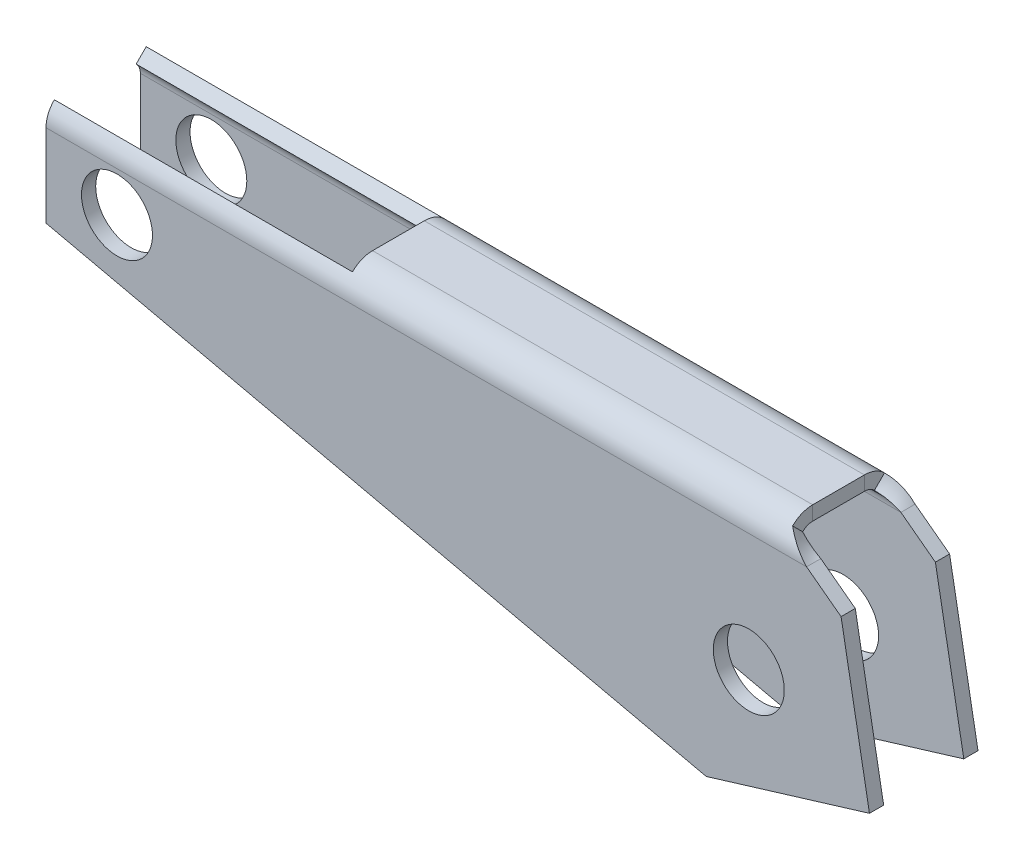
ISO-10303-21;
HEADER;
FILE_DESCRIPTION(('STEP AP214'),'2;1');
FILE_NAME('part.step','',(''),(''),'','','');
FILE_SCHEMA(('AUTOMOTIVE_DESIGN { 1 0 10303 214 1 1 1 1 }'));
ENDSEC;
DATA;
#1=APPLICATION_CONTEXT('core data for automotive mechanical design processes');
#2=APPLICATION_PROTOCOL_DEFINITION('international standard','automotive_design',2000,#1);
#3=PRODUCT_CONTEXT('',#1,'mechanical');
#4=PRODUCT('Part','Part','',(#3));
#5=PRODUCT_RELATED_PRODUCT_CATEGORY('part','',(#4));
#6=PRODUCT_DEFINITION_FORMATION('','',#4);
#7=PRODUCT_DEFINITION_CONTEXT('part definition',#1,'design');
#8=PRODUCT_DEFINITION('design','',#6,#7);
#9=PRODUCT_DEFINITION_SHAPE('','',#8);
#10=(LENGTH_UNIT() NAMED_UNIT(*) SI_UNIT(.MILLI.,.METRE.));
#11=(NAMED_UNIT(*) PLANE_ANGLE_UNIT() SI_UNIT($,.RADIAN.));
#12=(NAMED_UNIT(*) SI_UNIT($,.STERADIAN.) SOLID_ANGLE_UNIT());
#13=UNCERTAINTY_MEASURE_WITH_UNIT(LENGTH_MEASURE(1.E-05),#10,'distance_accuracy_value','');
#14=(GEOMETRIC_REPRESENTATION_CONTEXT(3) GLOBAL_UNCERTAINTY_ASSIGNED_CONTEXT((#13)) GLOBAL_UNIT_ASSIGNED_CONTEXT((#10,
#11,#12)) REPRESENTATION_CONTEXT('',''));
#15=CARTESIAN_POINT('',(0.,0.,0.));
#16=DIRECTION('',(0.,0.,1.));
#17=DIRECTION('',(1.,0.,0.));
#18=AXIS2_PLACEMENT_3D('',#15,#16,#17);
#19=CARTESIAN_POINT('',(-18.,10.9999999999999,13.2876110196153));
#20=DIRECTION('',(0.599999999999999,0.800000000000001,0.));
#21=DIRECTION('',(0.800000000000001,-0.599999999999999,0.));
#22=AXIS2_PLACEMENT_3D('',#19,#20,#21);
#23=PLANE('',#22);
#24=DIRECTION('',(0.800000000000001,-0.599999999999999,0.));
#25=VECTOR('',#24,1.);
#26=CARTESIAN_POINT('',(-18.,11.,11.2876110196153));
#27=LINE('',#26,#25);
#28=CARTESIAN_POINT('',(-14.8584073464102,8.64380550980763,11.2876110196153));
#29=VERTEX_POINT('',#28);
#30=CARTESIAN_POINT('',(-9.99999999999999,4.99999999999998,11.2876110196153));
#31=VERTEX_POINT('',#30);
#32=EDGE_CURVE('E544',#29,#31,#27,.T.);
#33=ORIENTED_EDGE('',*,*,#32,.F.);
#34=CARTESIAN_POINT('',(-14.8584073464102,8.64380550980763,13.2876110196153));
#35=CARTESIAN_POINT('',(-14.8584073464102,8.64380550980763,11.2876110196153));
#36=B_SPLINE_CURVE_WITH_KNOTS('',1,(#34,#35),.UNSPECIFIED.,.F.,.F.,(2,2),(0.,1.),.UNSPECIFIED.);
#37=CARTESIAN_POINT('',(-14.8584073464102,8.6438055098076,13.2876110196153));
#38=VERTEX_POINT('',#37);
#39=EDGE_CURVE('E40',#29,#38,#36,.F.);
#40=ORIENTED_EDGE('',*,*,#39,.T.);
#41=DIRECTION('',(0.800000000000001,-0.599999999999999,0.));
#42=VECTOR('',#41,1.);
#43=CARTESIAN_POINT('',(-18.,10.9999999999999,13.2876110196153));
#44=LINE('',#43,#42);
#45=CARTESIAN_POINT('',(-9.99999999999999,4.99999999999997,13.2876110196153));
#46=VERTEX_POINT('',#45);
#47=EDGE_CURVE('E85',#38,#46,#44,.T.);
#48=ORIENTED_EDGE('',*,*,#47,.T.);
#49=DIRECTION('',(0.,0.,-1.));
#50=VECTOR('',#49,1.);
#51=CARTESIAN_POINT('',(-9.99999999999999,4.99999999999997,13.2876110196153));
#52=LINE('',#51,#50);
#53=EDGE_CURVE('E546',#46,#31,#52,.T.);
#54=ORIENTED_EDGE('',*,*,#53,.T.);
#55=EDGE_LOOP('',(#33,#40,#48,#54));
#56=FACE_BOUND('',#55,.T.);
#57=ADVANCED_FACE('F31',(#56),#23,.T.);
#58=CARTESIAN_POINT('',(-122.,11.,13.2876110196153));
#59=DIRECTION('',(-1.,0.,0.));
#60=DIRECTION('',(0.,0.,-1.));
#61=AXIS2_PLACEMENT_3D('',#58,#59,#60);
#62=PLANE('',#61);
#63=DIRECTION('',(0.,1.,0.));
#64=VECTOR('',#63,1.);
#65=CARTESIAN_POINT('',(-122.,11.,13.2876110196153));
#66=LINE('',#65,#64);
#67=CARTESIAN_POINT('',(-122.,-3.00000000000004,13.2876110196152));
#68=VERTEX_POINT('',#67);
#69=CARTESIAN_POINT('',(-122.,8.6438055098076,13.2876110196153));
#70=VERTEX_POINT('',#69);
#71=EDGE_CURVE('E580',#68,#70,#66,.T.);
#72=ORIENTED_EDGE('',*,*,#71,.T.);
#73=DIRECTION('',(0.,0.,-1.));
#74=VECTOR('',#73,1.);
#75=CARTESIAN_POINT('',(-122.,8.64380550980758,13.2876110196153));
#76=LINE('',#75,#74);
#77=CARTESIAN_POINT('',(-122.,8.64380550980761,11.2876110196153));
#78=VERTEX_POINT('',#77);
#79=EDGE_CURVE('E575',#70,#78,#76,.T.);
#80=ORIENTED_EDGE('',*,*,#79,.T.);
#81=DIRECTION('',(0.,1.,0.));
#82=VECTOR('',#81,1.);
#83=CARTESIAN_POINT('',(-122.,11.,11.2876110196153));
#84=LINE('',#83,#82);
#85=CARTESIAN_POINT('',(-122.,-3.00000000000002,11.2876110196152));
#86=VERTEX_POINT('',#85);
#87=EDGE_CURVE('E571',#86,#78,#84,.T.);
#88=ORIENTED_EDGE('',*,*,#87,.F.);
#89=DIRECTION('',(0.,0.,-1.));
#90=VECTOR('',#89,1.);
#91=CARTESIAN_POINT('',(-122.,-3.00000000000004,13.2876110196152));
#92=LINE('',#91,#90);
#93=EDGE_CURVE('E58',#68,#86,#92,.T.);
#94=ORIENTED_EDGE('',*,*,#93,.F.);
#95=EDGE_LOOP('',(#72,#80,#88,#94));
#96=FACE_BOUND('',#95,.T.);
#97=ADVANCED_FACE('F522',(#96),#62,.T.);
#98=CARTESIAN_POINT('',(-122.,11.,13.2876110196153));
#99=DIRECTION('',(0.,0.,1.));
#100=DIRECTION('',(-1.,0.,0.));
#101=AXIS2_PLACEMENT_3D('',#98,#99,#100);
#102=PLANE('',#101);
#103=CARTESIAN_POINT('',(-23.,-8.00000000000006,13.2876110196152));
#104=DIRECTION('',(0.,0.,-1.));
#105=DIRECTION('',(-1.,0.,0.));
#106=AXIS2_PLACEMENT_3D('',#103,#104,#105);
#107=CIRCLE('',#106,5.);
#108=CARTESIAN_POINT('',(-28.,-8.00000000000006,13.2876110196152));
#109=VERTEX_POINT('',#108);
#110=EDGE_CURVE('E600',#109,#109,#107,.T.);
#111=ORIENTED_EDGE('',*,*,#110,.T.);
#112=EDGE_LOOP('',(#111));
#113=FACE_BOUND('',#112,.T.);
#114=CARTESIAN_POINT('',(-112.,2.99999999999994,13.2876110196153));
#115=DIRECTION('',(0.,0.,-1.));
#116=DIRECTION('',(-1.,0.,0.));
#117=AXIS2_PLACEMENT_3D('',#114,#115,#116);
#118=CIRCLE('',#117,5.);
#119=CARTESIAN_POINT('',(-117.,2.99999999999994,13.2876110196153));
#120=VERTEX_POINT('',#119);
#121=EDGE_CURVE('E550',#120,#120,#118,.T.);
#122=ORIENTED_EDGE('',*,*,#121,.T.);
#123=EDGE_LOOP('',(#122));
#124=FACE_BOUND('',#123,.T.);
#125=ORIENTED_EDGE('',*,*,#47,.F.);
#126=DIRECTION('',(-1.,0.,0.));
#127=VECTOR('',#126,1.);
#128=CARTESIAN_POINT('',(-122.,8.64380550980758,13.2876110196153));
#129=LINE('',#128,#127);
#130=EDGE_CURVE('E214',#38,#70,#129,.T.);
#131=ORIENTED_EDGE('',*,*,#130,.T.);
#132=ORIENTED_EDGE('',*,*,#71,.F.);
#133=DIRECTION('',(-0.975441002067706,0.220260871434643,0.));
#134=VECTOR('',#133,1.);
#135=CARTESIAN_POINT('',(-29.,-24.,13.2876110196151));
#136=LINE('',#135,#134);
#137=CARTESIAN_POINT('',(-29.,-24.,13.2876110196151));
#138=VERTEX_POINT('',#137);
#139=EDGE_CURVE('E592',#138,#68,#136,.T.);
#140=ORIENTED_EDGE('',*,*,#139,.F.);
#141=DIRECTION('',(-0.956673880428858,-0.291161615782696,0.));
#142=VECTOR('',#141,1.);
#143=CARTESIAN_POINT('',(-5.99999999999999,-17.,13.2876110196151));
#144=LINE('',#143,#142);
#145=CARTESIAN_POINT('',(-5.99999999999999,-17.,13.2876110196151));
#146=VERTEX_POINT('',#145);
#147=EDGE_CURVE('E594',#146,#138,#144,.T.);
#148=ORIENTED_EDGE('',*,*,#147,.F.);
#149=DIRECTION('',(0.178885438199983,-0.983869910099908,0.));
#150=VECTOR('',#149,1.);
#151=CARTESIAN_POINT('',(-9.99999999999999,4.99999999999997,13.2876110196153));
#152=LINE('',#151,#150);
#153=EDGE_CURVE('E570',#46,#146,#152,.T.);
#154=ORIENTED_EDGE('',*,*,#153,.F.);
#155=EDGE_LOOP('',(#125,#131,#132,#140,#148,#154));
#156=FACE_BOUND('',#155,.T.);
#157=ADVANCED_FACE('F518',(#113,#124,#156),#102,.T.);
#158=CARTESIAN_POINT('',(-29.,-24.,13.2876110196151));
#159=DIRECTION('',(-0.220260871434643,-0.975441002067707,0.));
#160=DIRECTION('',(-0.975441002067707,0.220260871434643,0.));
#161=AXIS2_PLACEMENT_3D('',#158,#159,#160);
#162=PLANE('',#161);
#163=DIRECTION('',(-0.975441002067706,0.220260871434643,0.));
#164=VECTOR('',#163,1.);
#165=CARTESIAN_POINT('',(-29.,-24.,11.2876110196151));
#166=LINE('',#165,#164);
#167=CARTESIAN_POINT('',(-29.,-24.,11.2876110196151));
#168=VERTEX_POINT('',#167);
#169=EDGE_CURVE('E587',#168,#86,#166,.T.);
#170=ORIENTED_EDGE('',*,*,#169,.F.);
#171=DIRECTION('',(0.,0.,-1.));
#172=VECTOR('',#171,1.);
#173=CARTESIAN_POINT('',(-29.,-24.,13.2876110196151));
#174=LINE('',#173,#172);
#175=EDGE_CURVE('E582',#138,#168,#174,.T.);
#176=ORIENTED_EDGE('',*,*,#175,.F.);
#177=ORIENTED_EDGE('',*,*,#139,.T.);
#178=ORIENTED_EDGE('',*,*,#93,.T.);
#179=EDGE_LOOP('',(#170,#176,#177,#178));
#180=FACE_BOUND('',#179,.T.);
#181=ADVANCED_FACE('F521',(#180),#162,.T.);
#182=CARTESIAN_POINT('',(-5.99999999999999,-17.,13.2876110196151));
#183=DIRECTION('',(0.291161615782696,-0.956673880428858,0.));
#184=DIRECTION('',(-0.956673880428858,-0.291161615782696,0.));
#185=AXIS2_PLACEMENT_3D('',#182,#183,#184);
#186=PLANE('',#185);
#187=DIRECTION('',(-0.956673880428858,-0.291161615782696,0.));
#188=VECTOR('',#187,1.);
#189=CARTESIAN_POINT('',(-6.,-17.,11.2876110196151));
#190=LINE('',#189,#188);
#191=CARTESIAN_POINT('',(-6.,-17.,11.2876110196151));
#192=VERTEX_POINT('',#191);
#193=EDGE_CURVE('E551',#192,#168,#190,.T.);
#194=ORIENTED_EDGE('',*,*,#193,.F.);
#195=DIRECTION('',(0.,0.,-1.));
#196=VECTOR('',#195,1.);
#197=CARTESIAN_POINT('',(-5.99999999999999,-17.,13.2876110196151));
#198=LINE('',#197,#196);
#199=EDGE_CURVE('E579',#146,#192,#198,.T.);
#200=ORIENTED_EDGE('',*,*,#199,.F.);
#201=ORIENTED_EDGE('',*,*,#147,.T.);
#202=ORIENTED_EDGE('',*,*,#175,.T.);
#203=EDGE_LOOP('',(#194,#200,#201,#202));
#204=FACE_BOUND('',#203,.T.);
#205=ADVANCED_FACE('F532',(#204),#186,.T.);
#206=CARTESIAN_POINT('',(-9.99999999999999,4.99999999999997,13.2876110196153));
#207=DIRECTION('',(0.983869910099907,0.178885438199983,0.));
#208=DIRECTION('',(0.178885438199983,-0.983869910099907,0.));
#209=AXIS2_PLACEMENT_3D('',#206,#207,#208);
#210=PLANE('',#209);
#211=DIRECTION('',(0.178885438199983,-0.983869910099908,0.));
#212=VECTOR('',#211,1.);
#213=CARTESIAN_POINT('',(-9.99999999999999,4.99999999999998,11.2876110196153));
#214=LINE('',#213,#212);
#215=EDGE_CURVE('E549',#31,#192,#214,.T.);
#216=ORIENTED_EDGE('',*,*,#215,.F.);
#217=ORIENTED_EDGE('',*,*,#53,.F.);
#218=ORIENTED_EDGE('',*,*,#153,.T.);
#219=ORIENTED_EDGE('',*,*,#199,.T.);
#220=EDGE_LOOP('',(#216,#217,#218,#219));
#221=FACE_BOUND('',#220,.T.);
#222=ADVANCED_FACE('F526',(#221),#210,.T.);
#223=CARTESIAN_POINT('',(-122.,11.,11.2876110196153));
#224=DIRECTION('',(0.,0.,1.));
#225=DIRECTION('',(-1.,0.,0.));
#226=AXIS2_PLACEMENT_3D('',#223,#224,#225);
#227=PLANE('',#226);
#228=DIRECTION('',(-1.,0.,0.));
#229=VECTOR('',#228,1.);
#230=CARTESIAN_POINT('',(-122.,8.64380550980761,11.2876110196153));
#231=LINE('',#230,#229);
#232=EDGE_CURVE('E11',#29,#78,#231,.T.);
#233=ORIENTED_EDGE('',*,*,#232,.F.);
#234=ORIENTED_EDGE('',*,*,#32,.T.);
#235=ORIENTED_EDGE('',*,*,#215,.T.);
#236=ORIENTED_EDGE('',*,*,#193,.T.);
#237=ORIENTED_EDGE('',*,*,#169,.T.);
#238=ORIENTED_EDGE('',*,*,#87,.T.);
#239=EDGE_LOOP('',(#233,#234,#235,#236,#237,#238));
#240=FACE_BOUND('',#239,.T.);
#241=CARTESIAN_POINT('',(-23.,-8.00000000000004,11.2876110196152));
#242=DIRECTION('',(0.,0.,-1.));
#243=DIRECTION('',(-1.,0.,0.));
#244=AXIS2_PLACEMENT_3D('',#241,#242,#243);
#245=CIRCLE('',#244,5.);
#246=CARTESIAN_POINT('',(-28.,-8.00000000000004,11.2876110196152));
#247=VERTEX_POINT('',#246);
#248=EDGE_CURVE('E602',#247,#247,#245,.T.);
#249=ORIENTED_EDGE('',*,*,#248,.F.);
#250=EDGE_LOOP('',(#249));
#251=FACE_BOUND('',#250,.T.);
#252=CARTESIAN_POINT('',(-112.,2.99999999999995,11.2876110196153));
#253=DIRECTION('',(0.,0.,-1.));
#254=DIRECTION('',(-1.,0.,0.));
#255=AXIS2_PLACEMENT_3D('',#252,#253,#254);
#256=CIRCLE('',#255,5.);
#257=CARTESIAN_POINT('',(-117.,2.99999999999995,11.2876110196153));
#258=VERTEX_POINT('',#257);
#259=EDGE_CURVE('E554',#258,#258,#256,.T.);
#260=ORIENTED_EDGE('',*,*,#259,.F.);
#261=EDGE_LOOP('',(#260));
#262=FACE_BOUND('',#261,.T.);
#263=ADVANCED_FACE('F516',(#240,#251,#262),#227,.F.);
#264=CARTESIAN_POINT('',(-112.,2.99999999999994,13.2876110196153));
#265=DIRECTION('',(0.,0.,-1.));
#266=DIRECTION('',(1.,0.,0.));
#267=AXIS2_PLACEMENT_3D('',#264,#265,#266);
#268=CYLINDRICAL_SURFACE('',#267,5.);
#269=ORIENTED_EDGE('',*,*,#121,.F.);
#270=EDGE_LOOP('',(#269));
#271=FACE_BOUND('',#270,.T.);
#272=ORIENTED_EDGE('',*,*,#259,.T.);
#273=EDGE_LOOP('',(#272));
#274=FACE_BOUND('',#273,.T.);
#275=ADVANCED_FACE('F512',(#271,#274),#268,.F.);
#276=CARTESIAN_POINT('',(-23.,-8.00000000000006,13.2876110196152));
#277=DIRECTION('',(0.,0.,-1.));
#278=DIRECTION('',(1.,0.,0.));
#279=AXIS2_PLACEMENT_3D('',#276,#277,#278);
#280=CYLINDRICAL_SURFACE('',#279,5.);
#281=ORIENTED_EDGE('',*,*,#110,.F.);
#282=EDGE_LOOP('',(#281));
#283=FACE_BOUND('',#282,.T.);
#284=ORIENTED_EDGE('',*,*,#248,.T.);
#285=EDGE_LOOP('',(#284));
#286=FACE_BOUND('',#285,.T.);
#287=ADVANCED_FACE('F501',(#283,#286),#280,.F.);
#288=CARTESIAN_POINT('',(-122.,10.6438055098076,11.6438055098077));
#289=DIRECTION('',(0.,1.,0.));
#290=DIRECTION('',(-1.,0.,0.));
#291=AXIS2_PLACEMENT_3D('',#288,#289,#290);
#292=PLANE('',#291);
#293=DIRECTION('',(0.,0.,1.));
#294=VECTOR('',#293,1.);
#295=CARTESIAN_POINT('',(-18.,10.6438055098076,11.6438055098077));
#296=LINE('',#295,#294);
#297=CARTESIAN_POINT('',(-17.9999999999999,10.6438055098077,2.00000000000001));
#298=VERTEX_POINT('',#297);
#299=CARTESIAN_POINT('',(-18.,10.6438055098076,9.2876110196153));
#300=VERTEX_POINT('',#299);
#301=EDGE_CURVE('E628',#298,#300,#296,.T.);
#302=ORIENTED_EDGE('',*,*,#301,.T.);
#303=DIRECTION('',(-1.,0.,0.));
#304=VECTOR('',#303,1.);
#305=CARTESIAN_POINT('',(-122.,10.6438055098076,9.28761101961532));
#306=LINE('',#305,#304);
#307=CARTESIAN_POINT('',(-79.9999999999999,10.6438055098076,9.28761101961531));
#308=VERTEX_POINT('',#307);
#309=EDGE_CURVE('E613',#300,#308,#306,.T.);
#310=ORIENTED_EDGE('',*,*,#309,.T.);
#311=DIRECTION('',(0.,0.,-1.));
#312=VECTOR('',#311,1.);
#313=CARTESIAN_POINT('',(-80.,10.6438055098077,-0.356194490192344));
#314=LINE('',#313,#312);
#315=CARTESIAN_POINT('',(-79.9999999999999,10.6438055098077,2.00000000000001));
#316=VERTEX_POINT('',#315);
#317=EDGE_CURVE('E448',#308,#316,#314,.T.);
#318=ORIENTED_EDGE('',*,*,#317,.T.);
#319=DIRECTION('',(-1.,0.,0.));
#320=VECTOR('',#319,1.);
#321=CARTESIAN_POINT('',(-122.,10.6438055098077,2.00000000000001));
#322=LINE('',#321,#320);
#323=EDGE_CURVE('E616',#298,#316,#322,.T.);
#324=ORIENTED_EDGE('',*,*,#323,.F.);
#325=EDGE_LOOP('',(#302,#310,#318,#324));
#326=FACE_BOUND('',#325,.T.);
#327=ADVANCED_FACE('F497',(#326),#292,.F.);
#328=CARTESIAN_POINT('',(-122.,12.6438055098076,11.6438055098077));
#329=DIRECTION('',(0.,1.,0.));
#330=DIRECTION('',(-1.,0.,0.));
#331=AXIS2_PLACEMENT_3D('',#328,#329,#330);
#332=PLANE('',#331);
#333=DIRECTION('',(-1.,0.,0.));
#334=VECTOR('',#333,1.);
#335=CARTESIAN_POINT('',(-122.,12.6438055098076,9.28761101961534));
#336=LINE('',#335,#334);
#337=CARTESIAN_POINT('',(-18.,12.6438055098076,9.28761101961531));
#338=VERTEX_POINT('',#337);
#339=CARTESIAN_POINT('',(-80.,12.6438055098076,9.28761101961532));
#340=VERTEX_POINT('',#339);
#341=EDGE_CURVE('E611',#338,#340,#336,.T.);
#342=ORIENTED_EDGE('',*,*,#341,.F.);
#343=DIRECTION('',(0.,0.,1.));
#344=VECTOR('',#343,1.);
#345=CARTESIAN_POINT('',(-18.,12.6438055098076,11.6438055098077));
#346=LINE('',#345,#344);
#347=CARTESIAN_POINT('',(-18.,12.6438055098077,2.00000000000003));
#348=VERTEX_POINT('',#347);
#349=EDGE_CURVE('E627',#348,#338,#346,.T.);
#350=ORIENTED_EDGE('',*,*,#349,.F.);
#351=DIRECTION('',(-1.,0.,0.));
#352=VECTOR('',#351,1.);
#353=CARTESIAN_POINT('',(-122.,12.6438055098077,2.00000000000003));
#354=LINE('',#353,#352);
#355=CARTESIAN_POINT('',(-79.9999999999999,12.6438055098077,2.00000000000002));
#356=VERTEX_POINT('',#355);
#357=EDGE_CURVE('E618',#348,#356,#354,.T.);
#358=ORIENTED_EDGE('',*,*,#357,.T.);
#359=DIRECTION('',(0.,0.,-1.));
#360=VECTOR('',#359,1.);
#361=CARTESIAN_POINT('',(-80.,12.6438055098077,-0.356194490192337));
#362=LINE('',#361,#360);
#363=EDGE_CURVE('E631',#340,#356,#362,.T.);
#364=ORIENTED_EDGE('',*,*,#363,.F.);
#365=EDGE_LOOP('',(#342,#350,#358,#364));
#366=FACE_BOUND('',#365,.T.);
#367=ADVANCED_FACE('F493',(#366),#332,.T.);
#368=CARTESIAN_POINT('',(-80.,12.6438055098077,-0.356194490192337));
#369=DIRECTION('',(-1.,0.,0.));
#370=DIRECTION('',(0.,0.,-1.));
#371=AXIS2_PLACEMENT_3D('',#368,#369,#370);
#372=PLANE('',#371);
#373=DIRECTION('',(0.,-1.,0.));
#374=VECTOR('',#373,1.);
#375=CARTESIAN_POINT('',(-80.,12.6438055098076,9.28761101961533));
#376=LINE('',#375,#374);
#377=EDGE_CURVE('E608',#340,#308,#376,.T.);
#378=ORIENTED_EDGE('',*,*,#377,.F.);
#379=ORIENTED_EDGE('',*,*,#363,.T.);
#380=DIRECTION('',(0.,-1.,0.));
#381=VECTOR('',#380,1.);
#382=CARTESIAN_POINT('',(-80.,12.6438055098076,2.00000000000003));
#383=LINE('',#382,#381);
#384=EDGE_CURVE('E621',#356,#316,#383,.T.);
#385=ORIENTED_EDGE('',*,*,#384,.T.);
#386=ORIENTED_EDGE('',*,*,#317,.F.);
#387=EDGE_LOOP('',(#378,#379,#385,#386));
#388=FACE_BOUND('',#387,.T.);
#389=ADVANCED_FACE('F496',(#388),#372,.T.);
#390=CARTESIAN_POINT('',(-18.,12.6438055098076,11.6438055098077));
#391=DIRECTION('',(1.,0.,0.));
#392=DIRECTION('',(0.,0.,1.));
#393=AXIS2_PLACEMENT_3D('',#390,#391,#392);
#394=PLANE('',#393);
#395=DIRECTION('',(0.,1.,0.));
#396=VECTOR('',#395,1.);
#397=CARTESIAN_POINT('',(-18.,12.6438055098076,9.28761101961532));
#398=LINE('',#397,#396);
#399=EDGE_CURVE('E220',#300,#338,#398,.T.);
#400=ORIENTED_EDGE('',*,*,#399,.F.);
#401=ORIENTED_EDGE('',*,*,#301,.F.);
#402=DIRECTION('',(0.,1.,0.));
#403=VECTOR('',#402,1.);
#404=CARTESIAN_POINT('',(-18.,12.6438055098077,2.00000000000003));
#405=LINE('',#404,#403);
#406=EDGE_CURVE('E624',#298,#348,#405,.T.);
#407=ORIENTED_EDGE('',*,*,#406,.T.);
#408=ORIENTED_EDGE('',*,*,#349,.T.);
#409=EDGE_LOOP('',(#400,#401,#407,#408));
#410=FACE_BOUND('',#409,.T.);
#411=ADVANCED_FACE('F503',(#410),#394,.T.);
#412=CARTESIAN_POINT('',(-122.,23.,0.));
#413=DIRECTION('',(0.,0.,-1.));
#414=DIRECTION('',(-1.,0.,0.));
#415=AXIS2_PLACEMENT_3D('',#412,#413,#414);
#416=PLANE('',#415);
#417=CARTESIAN_POINT('',(-23.,-8.,0.));
#418=DIRECTION('',(0.,0.,1.));
#419=DIRECTION('',(1.,0.,0.));
#420=AXIS2_PLACEMENT_3D('',#417,#418,#419);
#421=CIRCLE('',#420,5.);
#422=CARTESIAN_POINT('',(-18.,-8.,0.));
#423=VERTEX_POINT('',#422);
#424=EDGE_CURVE('E394',#423,#423,#421,.T.);
#425=ORIENTED_EDGE('',*,*,#424,.F.);
#426=EDGE_LOOP('',(#425));
#427=FACE_BOUND('',#426,.T.);
#428=CARTESIAN_POINT('',(-112.,3.,0.));
#429=DIRECTION('',(0.,0.,1.));
#430=DIRECTION('',(1.,0.,0.));
#431=AXIS2_PLACEMENT_3D('',#428,#429,#430);
#432=CIRCLE('',#431,5.);
#433=CARTESIAN_POINT('',(-107.,3.,0.));
#434=VERTEX_POINT('',#433);
#435=EDGE_CURVE('E399',#434,#434,#432,.T.);
#436=ORIENTED_EDGE('',*,*,#435,.F.);
#437=EDGE_LOOP('',(#436));
#438=FACE_BOUND('',#437,.T.);
#439=DIRECTION('',(-0.799999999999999,0.600000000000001,0.));
#440=VECTOR('',#439,1.);
#441=CARTESIAN_POINT('',(-18.,11.,0.));
#442=LINE('',#441,#440);
#443=CARTESIAN_POINT('',(-10.,5.,0.));
#444=VERTEX_POINT('',#443);
#445=CARTESIAN_POINT('',(-14.8584073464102,8.64380550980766,0.));
#446=VERTEX_POINT('',#445);
#447=EDGE_CURVE('E411',#444,#446,#442,.T.);
#448=ORIENTED_EDGE('',*,*,#447,.T.);
#449=DIRECTION('',(-1.,0.,0.));
#450=VECTOR('',#449,1.);
#451=CARTESIAN_POINT('',(-122.,8.64380550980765,0.));
#452=LINE('',#451,#450);
#453=CARTESIAN_POINT('',(-122.,8.64380550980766,0.));
#454=VERTEX_POINT('',#453);
#455=EDGE_CURVE('E433',#446,#454,#452,.T.);
#456=ORIENTED_EDGE('',*,*,#455,.T.);
#457=DIRECTION('',(0.,-1.,0.));
#458=VECTOR('',#457,1.);
#459=CARTESIAN_POINT('',(-122.,11.,0.));
#460=LINE('',#459,#458);
#461=CARTESIAN_POINT('',(-122.,-3.,0.));
#462=VERTEX_POINT('',#461);
#463=EDGE_CURVE('E405',#454,#462,#460,.T.);
#464=ORIENTED_EDGE('',*,*,#463,.T.);
#465=DIRECTION('',(0.975441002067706,-0.220260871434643,0.));
#466=VECTOR('',#465,1.);
#467=CARTESIAN_POINT('',(-29.,-24.,0.));
#468=LINE('',#467,#466);
#469=CARTESIAN_POINT('',(-29.,-24.,0.));
#470=VERTEX_POINT('',#469);
#471=EDGE_CURVE('E422',#462,#470,#468,.T.);
#472=ORIENTED_EDGE('',*,*,#471,.T.);
#473=DIRECTION('',(0.956673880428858,0.291161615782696,0.));
#474=VECTOR('',#473,1.);
#475=CARTESIAN_POINT('',(-6.,-17.,0.));
#476=LINE('',#475,#474);
#477=CARTESIAN_POINT('',(-6.,-17.,0.));
#478=VERTEX_POINT('',#477);
#479=EDGE_CURVE('E425',#470,#478,#476,.T.);
#480=ORIENTED_EDGE('',*,*,#479,.T.);
#481=DIRECTION('',(-0.178885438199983,0.983869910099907,0.));
#482=VECTOR('',#481,1.);
#483=CARTESIAN_POINT('',(-10.,5.,0.));
#484=LINE('',#483,#482);
#485=EDGE_CURVE('E428',#478,#444,#484,.T.);
#486=ORIENTED_EDGE('',*,*,#485,.T.);
#487=EDGE_LOOP('',(#448,#456,#464,#472,#480,#486));
#488=FACE_BOUND('',#487,.T.);
#489=ADVANCED_FACE('F475',(#427,#438,#488),#416,.F.);
#490=CARTESIAN_POINT('',(-18.,11.,-2.));
#491=DIRECTION('',(0.600000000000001,0.799999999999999,0.));
#492=DIRECTION('',(-0.799999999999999,0.600000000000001,0.));
#493=AXIS2_PLACEMENT_3D('',#490,#491,#492);
#494=PLANE('',#493);
#495=CARTESIAN_POINT('',(-14.8584073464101,8.64380550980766,0.));
#496=CARTESIAN_POINT('',(-14.8584073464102,8.64380550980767,-2.));
#497=B_SPLINE_CURVE_WITH_KNOTS('',1,(#495,#496),.UNSPECIFIED.,.F.,.F.,(2,2),(0.,1.),.UNSPECIFIED.);
#498=CARTESIAN_POINT('',(-14.8584073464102,8.64380550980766,-2.));
#499=VERTEX_POINT('',#498);
#500=EDGE_CURVE('E445',#446,#499,#497,.T.);
#501=ORIENTED_EDGE('',*,*,#500,.F.);
#502=ORIENTED_EDGE('',*,*,#447,.F.);
#503=DIRECTION('',(0.,0.,1.));
#504=VECTOR('',#503,1.);
#505=CARTESIAN_POINT('',(-10.,5.,-2.));
#506=LINE('',#505,#504);
#507=CARTESIAN_POINT('',(-10.,5.,-2.));
#508=VERTEX_POINT('',#507);
#509=EDGE_CURVE('E431',#508,#444,#506,.T.);
#510=ORIENTED_EDGE('',*,*,#509,.F.);
#511=DIRECTION('',(-0.799999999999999,0.600000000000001,0.));
#512=VECTOR('',#511,1.);
#513=CARTESIAN_POINT('',(-18.,11.,-2.));
#514=LINE('',#513,#512);
#515=EDGE_CURVE('E420',#508,#499,#514,.T.);
#516=ORIENTED_EDGE('',*,*,#515,.T.);
#517=EDGE_LOOP('',(#501,#502,#510,#516));
#518=FACE_BOUND('',#517,.T.);
#519=ADVANCED_FACE('F464',(#518),#494,.T.);
#520=CARTESIAN_POINT('',(-10.,5.,-2.));
#521=DIRECTION('',(0.983869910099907,0.178885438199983,0.));
#522=DIRECTION('',(-0.178885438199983,0.983869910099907,0.));
#523=AXIS2_PLACEMENT_3D('',#520,#521,#522);
#524=PLANE('',#523);
#525=ORIENTED_EDGE('',*,*,#485,.F.);
#526=DIRECTION('',(0.,0.,1.));
#527=VECTOR('',#526,1.);
#528=CARTESIAN_POINT('',(-6.,-17.,-2.));
#529=LINE('',#528,#527);
#530=CARTESIAN_POINT('',(-6.,-17.,-2.));
#531=VERTEX_POINT('',#530);
#532=EDGE_CURVE('E434',#531,#478,#529,.T.);
#533=ORIENTED_EDGE('',*,*,#532,.F.);
#534=DIRECTION('',(-0.178885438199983,0.983869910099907,0.));
#535=VECTOR('',#534,1.);
#536=CARTESIAN_POINT('',(-10.,5.,-2.));
#537=LINE('',#536,#535);
#538=EDGE_CURVE('E417',#531,#508,#537,.T.);
#539=ORIENTED_EDGE('',*,*,#538,.T.);
#540=ORIENTED_EDGE('',*,*,#509,.T.);
#541=EDGE_LOOP('',(#525,#533,#539,#540));
#542=FACE_BOUND('',#541,.T.);
#543=ADVANCED_FACE('F474',(#542),#524,.T.);
#544=CARTESIAN_POINT('',(-6.,-17.,-2.));
#545=DIRECTION('',(0.291161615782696,-0.956673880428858,0.));
#546=DIRECTION('',(0.956673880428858,0.291161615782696,0.));
#547=AXIS2_PLACEMENT_3D('',#544,#545,#546);
#548=PLANE('',#547);
#549=ORIENTED_EDGE('',*,*,#479,.F.);
#550=DIRECTION('',(0.,0.,1.));
#551=VECTOR('',#550,1.);
#552=CARTESIAN_POINT('',(-29.,-24.,-2.));
#553=LINE('',#552,#551);
#554=CARTESIAN_POINT('',(-29.,-24.,-2.));
#555=VERTEX_POINT('',#554);
#556=EDGE_CURVE('E436',#555,#470,#553,.T.);
#557=ORIENTED_EDGE('',*,*,#556,.F.);
#558=DIRECTION('',(0.956673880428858,0.291161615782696,0.));
#559=VECTOR('',#558,1.);
#560=CARTESIAN_POINT('',(-6.,-17.,-2.));
#561=LINE('',#560,#559);
#562=EDGE_CURVE('E414',#555,#531,#561,.T.);
#563=ORIENTED_EDGE('',*,*,#562,.T.);
#564=ORIENTED_EDGE('',*,*,#532,.T.);
#565=EDGE_LOOP('',(#549,#557,#563,#564));
#566=FACE_BOUND('',#565,.T.);
#567=ADVANCED_FACE('F479',(#566),#548,.T.);
#568=CARTESIAN_POINT('',(-29.,-24.,-2.));
#569=DIRECTION('',(-0.220260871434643,-0.975441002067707,0.));
#570=DIRECTION('',(0.975441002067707,-0.220260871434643,0.));
#571=AXIS2_PLACEMENT_3D('',#568,#569,#570);
#572=PLANE('',#571);
#573=ORIENTED_EDGE('',*,*,#471,.F.);
#574=DIRECTION('',(0.,0.,1.));
#575=VECTOR('',#574,1.);
#576=CARTESIAN_POINT('',(-122.,-3.,-2.));
#577=LINE('',#576,#575);
#578=CARTESIAN_POINT('',(-122.,-3.,-2.));
#579=VERTEX_POINT('',#578);
#580=EDGE_CURVE('E438',#579,#462,#577,.T.);
#581=ORIENTED_EDGE('',*,*,#580,.F.);
#582=DIRECTION('',(0.975441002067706,-0.220260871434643,0.));
#583=VECTOR('',#582,1.);
#584=CARTESIAN_POINT('',(-29.,-24.,-2.));
#585=LINE('',#584,#583);
#586=EDGE_CURVE('E410',#579,#555,#585,.T.);
#587=ORIENTED_EDGE('',*,*,#586,.T.);
#588=ORIENTED_EDGE('',*,*,#556,.T.);
#589=EDGE_LOOP('',(#573,#581,#587,#588));
#590=FACE_BOUND('',#589,.T.);
#591=ADVANCED_FACE('F483',(#590),#572,.T.);
#592=CARTESIAN_POINT('',(-122.,11.,-2.));
#593=DIRECTION('',(-1.,0.,0.));
#594=DIRECTION('',(0.,-1.,0.));
#595=AXIS2_PLACEMENT_3D('',#592,#593,#594);
#596=PLANE('',#595);
#597=DIRECTION('',(0.,0.,1.));
#598=VECTOR('',#597,1.);
#599=CARTESIAN_POINT('',(-122.,8.64380550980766,-2.00000000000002));
#600=LINE('',#599,#598);
#601=CARTESIAN_POINT('',(-122.,8.64380550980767,-2.));
#602=VERTEX_POINT('',#601);
#603=EDGE_CURVE('E441',#602,#454,#600,.T.);
#604=ORIENTED_EDGE('',*,*,#603,.F.);
#605=DIRECTION('',(0.,-1.,0.));
#606=VECTOR('',#605,1.);
#607=CARTESIAN_POINT('',(-122.,11.,-2.));
#608=LINE('',#607,#606);
#609=EDGE_CURVE('E408',#602,#579,#608,.T.);
#610=ORIENTED_EDGE('',*,*,#609,.T.);
#611=ORIENTED_EDGE('',*,*,#580,.T.);
#612=ORIENTED_EDGE('',*,*,#463,.F.);
#613=EDGE_LOOP('',(#604,#610,#611,#612));
#614=FACE_BOUND('',#613,.T.);
#615=ADVANCED_FACE('F487',(#614),#596,.T.);
#616=CARTESIAN_POINT('',(-122.,23.,-2.));
#617=DIRECTION('',(0.,0.,-1.));
#618=DIRECTION('',(-1.,0.,0.));
#619=AXIS2_PLACEMENT_3D('',#616,#617,#618);
#620=PLANE('',#619);
#621=DIRECTION('',(-1.,0.,0.));
#622=VECTOR('',#621,1.);
#623=CARTESIAN_POINT('',(-122.,8.64380550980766,-2.));
#624=LINE('',#623,#622);
#625=EDGE_CURVE('E444',#499,#602,#624,.T.);
#626=ORIENTED_EDGE('',*,*,#625,.F.);
#627=ORIENTED_EDGE('',*,*,#515,.F.);
#628=ORIENTED_EDGE('',*,*,#538,.F.);
#629=ORIENTED_EDGE('',*,*,#562,.F.);
#630=ORIENTED_EDGE('',*,*,#586,.F.);
#631=ORIENTED_EDGE('',*,*,#609,.F.);
#632=EDGE_LOOP('',(#626,#627,#628,#629,#630,#631));
#633=FACE_BOUND('',#632,.T.);
#634=CARTESIAN_POINT('',(-23.,-8.,-2.));
#635=DIRECTION('',(0.,0.,1.));
#636=DIRECTION('',(1.,0.,0.));
#637=AXIS2_PLACEMENT_3D('',#634,#635,#636);
#638=CIRCLE('',#637,5.);
#639=CARTESIAN_POINT('',(-18.,-8.,-2.));
#640=VERTEX_POINT('',#639);
#641=EDGE_CURVE('E396',#640,#640,#638,.T.);
#642=ORIENTED_EDGE('',*,*,#641,.T.);
#643=EDGE_LOOP('',(#642));
#644=FACE_BOUND('',#643,.T.);
#645=CARTESIAN_POINT('',(-112.,3.,-2.));
#646=DIRECTION('',(0.,0.,1.));
#647=DIRECTION('',(1.,0.,0.));
#648=AXIS2_PLACEMENT_3D('',#645,#646,#647);
#649=CIRCLE('',#648,5.);
#650=CARTESIAN_POINT('',(-107.,3.,-2.));
#651=VERTEX_POINT('',#650);
#652=EDGE_CURVE('E402',#651,#651,#649,.T.);
#653=ORIENTED_EDGE('',*,*,#652,.T.);
#654=EDGE_LOOP('',(#653));
#655=FACE_BOUND('',#654,.T.);
#656=ADVANCED_FACE('F491',(#633,#644,#655),#620,.T.);
#657=CARTESIAN_POINT('',(-112.,3.,-2.));
#658=DIRECTION('',(0.,0.,1.));
#659=DIRECTION('',(1.,0.,0.));
#660=AXIS2_PLACEMENT_3D('',#657,#658,#659);
#661=CYLINDRICAL_SURFACE('',#660,5.);
#662=ORIENTED_EDGE('',*,*,#652,.F.);
#663=EDGE_LOOP('',(#662));
#664=FACE_BOUND('',#663,.T.);
#665=ORIENTED_EDGE('',*,*,#435,.T.);
#666=EDGE_LOOP('',(#665));
#667=FACE_BOUND('',#666,.T.);
#668=ADVANCED_FACE('F712',(#664,#667),#661,.F.);
#669=CARTESIAN_POINT('',(-23.,-8.,-2.));
#670=DIRECTION('',(0.,0.,1.));
#671=DIRECTION('',(1.,0.,0.));
#672=AXIS2_PLACEMENT_3D('',#669,#670,#671);
#673=CYLINDRICAL_SURFACE('',#672,5.);
#674=ORIENTED_EDGE('',*,*,#641,.F.);
#675=EDGE_LOOP('',(#674));
#676=FACE_BOUND('',#675,.T.);
#677=ORIENTED_EDGE('',*,*,#424,.T.);
#678=EDGE_LOOP('',(#677));
#679=FACE_BOUND('',#678,.T.);
#680=ADVANCED_FACE('F719',(#676,#679),#673,.F.);
#681=CARTESIAN_POINT('',(-80.,8.64380550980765,2.));
#682=DIRECTION('',(1.,0.,0.));
#683=DIRECTION('',(0.,0.,-1.));
#684=AXIS2_PLACEMENT_3D('',#681,#682,#683);
#685=PLANE('',#684);
#686=DIRECTION('',(0.,0.707106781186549,-0.707106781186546));
#687=VECTOR('',#686,1.);
#688=CARTESIAN_POINT('',(-80.,10.7651258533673,-0.121320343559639));
#689=LINE('',#688,#687);
#690=CARTESIAN_POINT('',(-79.9999999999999,10.0580190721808,0.585786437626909));
#691=VERTEX_POINT('',#690);
#692=CARTESIAN_POINT('',(-79.9999999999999,11.4722326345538,-0.828427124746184));
#693=VERTEX_POINT('',#692);
#694=EDGE_CURVE('E387',#691,#693,#689,.T.);
#695=ORIENTED_EDGE('',*,*,#694,.F.);
#696=CARTESIAN_POINT('',(-79.9999999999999,8.64380550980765,2.));
#697=DIRECTION('',(-1.,0.,0.));
#698=DIRECTION('',(0.,-1.,0.));
#699=AXIS2_PLACEMENT_3D('',#696,#697,#698);
#700=CIRCLE('',#699,2.);
#701=EDGE_CURVE('E297',#316,#691,#700,.T.);
#702=ORIENTED_EDGE('',*,*,#701,.F.);
#703=ORIENTED_EDGE('',*,*,#384,.F.);
#704=CARTESIAN_POINT('',(-79.9999999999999,8.64380550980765,2.));
#705=DIRECTION('',(-1.,0.,0.));
#706=DIRECTION('',(0.,-1.,0.));
#707=AXIS2_PLACEMENT_3D('',#704,#705,#706);
#708=CIRCLE('',#707,4.);
#709=EDGE_CURVE('E286',#356,#693,#708,.T.);
#710=ORIENTED_EDGE('',*,*,#709,.T.);
#711=EDGE_LOOP('',(#695,#702,#703,#710));
#712=FACE_BOUND('',#711,.T.);
#713=ADVANCED_FACE('F699',(#712),#685,.F.);
#714=CARTESIAN_POINT('',(-18.,8.64380550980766,2.));
#715=DIRECTION('',(-1.,0.,0.));
#716=DIRECTION('',(0.,0.,1.));
#717=AXIS2_PLACEMENT_3D('',#714,#715,#716);
#718=PLANE('',#717);
#719=ORIENTED_EDGE('',*,*,#406,.F.);
#720=CARTESIAN_POINT('',(-17.9999999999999,8.64380550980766,2.));
#721=DIRECTION('',(-1.,0.,0.));
#722=DIRECTION('',(0.,-1.,0.));
#723=AXIS2_PLACEMENT_3D('',#720,#721,#722);
#724=CIRCLE('',#723,2.);
#725=CARTESIAN_POINT('',(-17.9999999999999,10.0580190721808,0.585786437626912));
#726=VERTEX_POINT('',#725);
#727=EDGE_CURVE('E300',#726,#298,#724,.F.);
#728=ORIENTED_EDGE('',*,*,#727,.F.);
#729=CARTESIAN_POINT('',(-18.,11.4722326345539,-0.828427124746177));
#730=CARTESIAN_POINT('',(-17.9999999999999,10.0580190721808,0.585786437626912));
#731=B_SPLINE_CURVE_WITH_KNOTS('',1,(#729,#730),.UNSPECIFIED.,.F.,.F.,(2,2),(0.,1.),.UNSPECIFIED.);
#732=CARTESIAN_POINT('',(-17.9999999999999,11.4722326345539,-0.828427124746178));
#733=VERTEX_POINT('',#732);
#734=EDGE_CURVE('E371',#726,#733,#731,.F.);
#735=ORIENTED_EDGE('',*,*,#734,.T.);
#736=CARTESIAN_POINT('',(-17.9999999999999,8.64380550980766,2.));
#737=DIRECTION('',(-1.,0.,0.));
#738=DIRECTION('',(0.,-1.,0.));
#739=AXIS2_PLACEMENT_3D('',#736,#737,#738);
#740=CIRCLE('',#739,4.);
#741=EDGE_CURVE('E289',#733,#348,#740,.F.);
#742=ORIENTED_EDGE('',*,*,#741,.T.);
#743=EDGE_LOOP('',(#719,#728,#735,#742));
#744=FACE_BOUND('',#743,.T.);
#745=ADVANCED_FACE('F336',(#744),#718,.F.);
#746=CARTESIAN_POINT('',(-14.8584073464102,8.64380550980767,-2.));
#747=CARTESIAN_POINT('',(-15.3820533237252,9.16745148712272,-1.99999999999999));
#748=CARTESIAN_POINT('',(-15.9056048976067,9.69079704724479,-1.89589070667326));
#749=CARTESIAN_POINT('',(-16.9528024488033,10.6582814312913,-1.49514555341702));
#750=CARTESIAN_POINT('',(-17.4763540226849,11.1019590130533,-1.1987007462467));
#751=CARTESIAN_POINT('',(-18.,11.4722326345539,-0.828427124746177));
#752=CARTESIAN_POINT('',(-14.8584073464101,8.64380550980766,0.));
#753=CARTESIAN_POINT('',(-15.3820250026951,8.90561433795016,0.));
#754=CARTESIAN_POINT('',(-15.9056048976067,9.16730127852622,0.0520546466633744));
#755=CARTESIAN_POINT('',(-16.9528024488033,9.65104347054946,0.252427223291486));
#756=CARTESIAN_POINT('',(-17.4763823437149,9.8728922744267,0.400659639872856));
#757=CARTESIAN_POINT('',(-17.9999999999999,10.0580190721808,0.585786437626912));
#758=B_SPLINE_SURFACE_WITH_KNOTS('',1,3,((#746,#747,#748,#749,#750,#751),(#752,#753,#754,#755,
#756,#757)),.UNSPECIFIED.,.F.,.F.,.F.,(2,2),(4,2,4),(0.,1.),(0.,0.5,1.),.UNSPECIFIED.);
#759=CARTESIAN_POINT('',(-17.9999999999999,10.0580190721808,0.585786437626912));
#760=CARTESIAN_POINT('',(-17.4763823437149,9.8728922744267,0.400659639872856));
#761=CARTESIAN_POINT('',(-16.9528024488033,9.65104347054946,0.252427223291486));
#762=CARTESIAN_POINT('',(-15.9056048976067,9.16730127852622,0.0520546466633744));
#763=CARTESIAN_POINT('',(-15.3820250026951,8.90561433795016,0.));
#764=CARTESIAN_POINT('',(-14.8584073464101,8.64380550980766,0.));
#765=B_SPLINE_CURVE_WITH_KNOTS('',3,(#759,#760,#761,#762,#763,#764),.UNSPECIFIED.,.F.,.F.,(4,2,
4),(0.,0.5,1.),.UNSPECIFIED.);
#766=EDGE_CURVE('E278',#446,#726,#765,.F.);
#767=CARTESIAN_POINT('',(-14.8584073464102,8.64380550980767,-2.));
#768=CARTESIAN_POINT('',(-15.3820533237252,9.16745148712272,-1.99999999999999));
#769=CARTESIAN_POINT('',(-15.9056048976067,9.69079704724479,-1.89589070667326));
#770=CARTESIAN_POINT('',(-16.9528024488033,10.6582814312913,-1.49514555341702));
#771=CARTESIAN_POINT('',(-17.4763540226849,11.1019590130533,-1.1987007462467));
#772=CARTESIAN_POINT('',(-18.,11.4722326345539,-0.828427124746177));
#773=B_SPLINE_CURVE_WITH_KNOTS('',3,(#767,#768,#769,#770,#771,#772),.UNSPECIFIED.,.F.,.F.,(4,2,
4),(0.,0.5,1.),.UNSPECIFIED.);
#774=EDGE_CURVE('E295',#499,#733,#773,.T.);
#775=ORIENTED_EDGE('',*,*,#734,.F.);
#776=ORIENTED_EDGE('',*,*,#766,.F.);
#777=ORIENTED_EDGE('',*,*,#500,.T.);
#778=ORIENTED_EDGE('',*,*,#774,.T.);
#779=EDGE_LOOP('',(#775,#776,#777,#778));
#780=FACE_BOUND('',#779,.T.);
#781=ADVANCED_FACE('F329',(#780),#758,.F.);
#782=CARTESIAN_POINT('',(-122.,8.64380550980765,2.));
#783=DIRECTION('',(1.,0.,0.));
#784=DIRECTION('',(0.,0.,-1.));
#785=AXIS2_PLACEMENT_3D('',#782,#783,#784);
#786=PLANE('',#785);
#787=ORIENTED_EDGE('',*,*,#603,.T.);
#788=CARTESIAN_POINT('',(-122.,8.64380550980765,2.));
#789=DIRECTION('',(-1.,0.,0.));
#790=DIRECTION('',(0.,-1.,0.));
#791=AXIS2_PLACEMENT_3D('',#788,#789,#790);
#792=CIRCLE('',#791,2.);
#793=CARTESIAN_POINT('',(-122.,10.0580190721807,0.585786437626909));
#794=VERTEX_POINT('',#793);
#795=EDGE_CURVE('E292',#794,#454,#792,.T.);
#796=ORIENTED_EDGE('',*,*,#795,.F.);
#797=DIRECTION('',(0.,0.707106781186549,-0.707106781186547));
#798=VECTOR('',#797,1.);
#799=CARTESIAN_POINT('',(-122.,10.7651258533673,-0.121320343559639));
#800=LINE('',#799,#798);
#801=CARTESIAN_POINT('',(-122.,11.4722326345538,-0.828427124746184));
#802=VERTEX_POINT('',#801);
#803=EDGE_CURVE('E284',#794,#802,#800,.T.);
#804=ORIENTED_EDGE('',*,*,#803,.T.);
#805=CARTESIAN_POINT('',(-122.,8.64380550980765,2.));
#806=DIRECTION('',(-1.,0.,0.));
#807=DIRECTION('',(0.,-1.,0.));
#808=AXIS2_PLACEMENT_3D('',#805,#806,#807);
#809=CIRCLE('',#808,4.);
#810=EDGE_CURVE('E281',#802,#602,#809,.T.);
#811=ORIENTED_EDGE('',*,*,#810,.T.);
#812=EDGE_LOOP('',(#787,#796,#804,#811));
#813=FACE_BOUND('',#812,.T.);
#814=ADVANCED_FACE('F326',(#813),#786,.F.);
#815=CARTESIAN_POINT('',(-101.,10.7651258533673,-0.121320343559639));
#816=DIRECTION('',(0.,-0.707106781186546,-0.707106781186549));
#817=DIRECTION('',(-1.,0.,0.));
#818=AXIS2_PLACEMENT_3D('',#815,#816,#817);
#819=PLANE('',#818);
#820=DIRECTION('',(-1.,0.,0.));
#821=VECTOR('',#820,1.);
#822=CARTESIAN_POINT('',(134.070405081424,10.0580190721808,0.585786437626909));
#823=LINE('',#822,#821);
#824=EDGE_CURVE('E296',#691,#794,#823,.T.);
#825=ORIENTED_EDGE('',*,*,#824,.F.);
#826=ORIENTED_EDGE('',*,*,#694,.T.);
#827=DIRECTION('',(-1.,0.,0.));
#828=VECTOR('',#827,1.);
#829=CARTESIAN_POINT('',(134.070405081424,11.4722326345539,-0.828427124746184));
#830=LINE('',#829,#828);
#831=EDGE_CURVE('E285',#693,#802,#830,.T.);
#832=ORIENTED_EDGE('',*,*,#831,.T.);
#833=ORIENTED_EDGE('',*,*,#803,.F.);
#834=EDGE_LOOP('',(#825,#826,#832,#833));
#835=FACE_BOUND('',#834,.T.);
#836=ADVANCED_FACE('F323',(#835),#819,.F.);
#837=CARTESIAN_POINT('',(134.070405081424,8.64380550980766,2.));
#838=DIRECTION('',(-1.,0.,0.));
#839=DIRECTION('',(0.,-1.,0.));
#840=AXIS2_PLACEMENT_3D('',#837,#838,#839);
#841=CYLINDRICAL_SURFACE('',#840,4.);
#842=ORIENTED_EDGE('',*,*,#810,.F.);
#843=ORIENTED_EDGE('',*,*,#831,.F.);
#844=ORIENTED_EDGE('',*,*,#709,.F.);
#845=ORIENTED_EDGE('',*,*,#357,.F.);
#846=ORIENTED_EDGE('',*,*,#741,.F.);
#847=ORIENTED_EDGE('',*,*,#774,.F.);
#848=ORIENTED_EDGE('',*,*,#625,.T.);
#849=EDGE_LOOP('',(#842,#843,#844,#845,#846,#847,#848));
#850=FACE_BOUND('',#849,.T.);
#851=ADVANCED_FACE('F321',(#850),#841,.T.);
#852=CARTESIAN_POINT('',(134.070405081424,8.64380550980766,2.));
#853=DIRECTION('',(-1.,0.,0.));
#854=DIRECTION('',(0.,-1.,0.));
#855=AXIS2_PLACEMENT_3D('',#852,#853,#854);
#856=CYLINDRICAL_SURFACE('',#855,2.);
#857=ORIENTED_EDGE('',*,*,#795,.T.);
#858=ORIENTED_EDGE('',*,*,#455,.F.);
#859=ORIENTED_EDGE('',*,*,#766,.T.);
#860=ORIENTED_EDGE('',*,*,#727,.T.);
#861=ORIENTED_EDGE('',*,*,#323,.T.);
#862=ORIENTED_EDGE('',*,*,#701,.T.);
#863=ORIENTED_EDGE('',*,*,#824,.T.);
#864=EDGE_LOOP('',(#857,#858,#859,#860,#861,#862,#863));
#865=FACE_BOUND('',#864,.T.);
#866=ADVANCED_FACE('F310',(#865),#856,.F.);
#867=CARTESIAN_POINT('',(-122.,8.64380550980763,9.28761101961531));
#868=DIRECTION('',(1.,0.,0.));
#869=DIRECTION('',(0.,1.,0.));
#870=AXIS2_PLACEMENT_3D('',#867,#868,#869);
#871=PLANE('',#870);
#872=DIRECTION('',(0.,0.707106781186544,0.707106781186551));
#873=VECTOR('',#872,1.);
#874=CARTESIAN_POINT('',(-122.,10.7651258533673,11.408931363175));
#875=LINE('',#874,#873);
#876=CARTESIAN_POINT('',(-122.,10.0580190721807,10.7018245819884));
#877=VERTEX_POINT('',#876);
#878=CARTESIAN_POINT('',(-122.,11.4722326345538,12.1160381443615));
#879=VERTEX_POINT('',#878);
#880=EDGE_CURVE('E201',#877,#879,#875,.T.);
#881=ORIENTED_EDGE('',*,*,#880,.F.);
#882=CARTESIAN_POINT('',(-122.,8.64380550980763,9.28761101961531));
#883=DIRECTION('',(-1.,0.,0.));
#884=DIRECTION('',(0.,0.,1.));
#885=AXIS2_PLACEMENT_3D('',#882,#883,#884);
#886=CIRCLE('',#885,2.);
#887=EDGE_CURVE('E679',#78,#877,#886,.T.);
#888=ORIENTED_EDGE('',*,*,#887,.F.);
#889=ORIENTED_EDGE('',*,*,#79,.F.);
#890=CARTESIAN_POINT('',(-122.,8.64380550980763,9.28761101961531));
#891=DIRECTION('',(-1.,0.,0.));
#892=DIRECTION('',(0.,0.,1.));
#893=AXIS2_PLACEMENT_3D('',#890,#891,#892);
#894=CIRCLE('',#893,4.);
#895=EDGE_CURVE('E215',#70,#879,#894,.T.);
#896=ORIENTED_EDGE('',*,*,#895,.T.);
#897=EDGE_LOOP('',(#881,#888,#889,#896));
#898=FACE_BOUND('',#897,.T.);
#899=ADVANCED_FACE('F320',(#898),#871,.F.);
#900=CARTESIAN_POINT('',(-18.,11.4722326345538,12.1160381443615));
#901=CARTESIAN_POINT('',(-17.4763540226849,11.1019590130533,12.486311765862));
#902=CARTESIAN_POINT('',(-16.9528024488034,10.6582814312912,12.7827565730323));
#903=CARTESIAN_POINT('',(-15.9056048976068,9.69079704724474,13.1835017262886));
#904=CARTESIAN_POINT('',(-15.3820533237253,9.16745148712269,13.2876110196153));
#905=CARTESIAN_POINT('',(-14.8584073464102,8.64380550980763,13.2876110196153));
#906=CARTESIAN_POINT('',(-18.,10.0580190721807,10.7018245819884));
#907=CARTESIAN_POINT('',(-17.476382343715,9.87289227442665,10.8869513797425));
#908=CARTESIAN_POINT('',(-16.9528024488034,9.65104347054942,11.0351837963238));
#909=CARTESIAN_POINT('',(-15.9056048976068,9.16730127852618,11.2355563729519));
#910=CARTESIAN_POINT('',(-15.3820250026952,8.90561433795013,11.2876110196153));
#911=CARTESIAN_POINT('',(-14.8584073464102,8.64380550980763,11.2876110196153));
#912=B_SPLINE_SURFACE_WITH_KNOTS('',1,3,((#900,#901,#902,#903,#904,#905),(#906,#907,#908,#909,
#910,#911)),.UNSPECIFIED.,.F.,.F.,.F.,(2,2),(4,2,4),(0.,1.),(0.,0.5,1.),.UNSPECIFIED.);
#913=CARTESIAN_POINT('',(-14.8584073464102,8.64380550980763,11.2876110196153));
#914=CARTESIAN_POINT('',(-15.3820250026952,8.90561433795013,11.2876110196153));
#915=CARTESIAN_POINT('',(-15.9056048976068,9.16730127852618,11.2355563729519));
#916=CARTESIAN_POINT('',(-16.9528024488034,9.65104347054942,11.0351837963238));
#917=CARTESIAN_POINT('',(-17.476382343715,9.87289227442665,10.8869513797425));
#918=CARTESIAN_POINT('',(-18.,10.0580190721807,10.7018245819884));
#919=B_SPLINE_CURVE_WITH_KNOTS('',3,(#913,#914,#915,#916,#917,#918),.UNSPECIFIED.,.F.,.F.,(4,2,
4),(0.,0.5,1.),.UNSPECIFIED.);
#920=CARTESIAN_POINT('',(-18.,10.0580190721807,10.7018245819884));
#921=VERTEX_POINT('',#920);
#922=EDGE_CURVE('E194',#921,#29,#919,.F.);
#923=CARTESIAN_POINT('',(-18.,10.0580190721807,10.7018245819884));
#924=CARTESIAN_POINT('',(-18.,11.4722326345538,12.1160381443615));
#925=B_SPLINE_CURVE_WITH_KNOTS('',1,(#923,#924),.UNSPECIFIED.,.F.,.F.,(2,2),(0.,1.),.UNSPECIFIED.);
#926=CARTESIAN_POINT('',(-18.,11.4722326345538,12.1160381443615));
#927=VERTEX_POINT('',#926);
#928=EDGE_CURVE('E190',#921,#927,#925,.T.);
#929=CARTESIAN_POINT('',(-18.,11.4722326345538,12.1160381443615));
#930=CARTESIAN_POINT('',(-17.4763540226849,11.1019590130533,12.486311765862));
#931=CARTESIAN_POINT('',(-16.9528024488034,10.6582814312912,12.7827565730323));
#932=CARTESIAN_POINT('',(-15.9056048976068,9.69079704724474,13.1835017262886));
#933=CARTESIAN_POINT('',(-15.3820533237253,9.16745148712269,13.2876110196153));
#934=CARTESIAN_POINT('',(-14.8584073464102,8.64380550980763,13.2876110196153));
#935=B_SPLINE_CURVE_WITH_KNOTS('',3,(#929,#930,#931,#932,#933,#934),.UNSPECIFIED.,.F.,.F.,(4,2,
4),(0.,0.5,1.),.UNSPECIFIED.);
#936=EDGE_CURVE('E48',#927,#38,#935,.T.);
#937=ORIENTED_EDGE('',*,*,#39,.F.);
#938=ORIENTED_EDGE('',*,*,#922,.F.);
#939=ORIENTED_EDGE('',*,*,#928,.T.);
#940=ORIENTED_EDGE('',*,*,#936,.T.);
#941=EDGE_LOOP('',(#937,#938,#939,#940));
#942=FACE_BOUND('',#941,.T.);
#943=ADVANCED_FACE('F192',(#942),#912,.F.);
#944=CARTESIAN_POINT('',(-18.,8.64380550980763,9.28761101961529));
#945=DIRECTION('',(-1.,0.,0.));
#946=DIRECTION('',(0.,-1.,0.));
#947=AXIS2_PLACEMENT_3D('',#944,#945,#946);
#948=PLANE('',#947);
#949=ORIENTED_EDGE('',*,*,#928,.F.);
#950=CARTESIAN_POINT('',(-18.,8.64380550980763,9.28761101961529));
#951=DIRECTION('',(-1.,0.,0.));
#952=DIRECTION('',(0.,0.,1.));
#953=AXIS2_PLACEMENT_3D('',#950,#951,#952);
#954=CIRCLE('',#953,2.);
#955=EDGE_CURVE('E683',#300,#921,#954,.F.);
#956=ORIENTED_EDGE('',*,*,#955,.F.);
#957=ORIENTED_EDGE('',*,*,#399,.T.);
#958=CARTESIAN_POINT('',(-18.,8.64380550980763,9.28761101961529));
#959=DIRECTION('',(-1.,0.,0.));
#960=DIRECTION('',(0.,0.,1.));
#961=AXIS2_PLACEMENT_3D('',#958,#959,#960);
#962=CIRCLE('',#961,4.);
#963=EDGE_CURVE('E211',#338,#927,#962,.F.);
#964=ORIENTED_EDGE('',*,*,#963,.T.);
#965=EDGE_LOOP('',(#949,#956,#957,#964));
#966=FACE_BOUND('',#965,.T.);
#967=ADVANCED_FACE('F219',(#966),#948,.F.);
#968=CARTESIAN_POINT('',(-79.9999999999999,8.64380550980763,9.2876110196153));
#969=DIRECTION('',(1.,0.,0.));
#970=DIRECTION('',(0.,1.,0.));
#971=AXIS2_PLACEMENT_3D('',#968,#969,#970);
#972=PLANE('',#971);
#973=ORIENTED_EDGE('',*,*,#377,.T.);
#974=CARTESIAN_POINT('',(-79.9999999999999,8.64380550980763,9.2876110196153));
#975=DIRECTION('',(-1.,0.,0.));
#976=DIRECTION('',(0.,0.,1.));
#977=AXIS2_PLACEMENT_3D('',#974,#975,#976);
#978=CIRCLE('',#977,2.);
#979=CARTESIAN_POINT('',(-79.9999999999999,10.0580190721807,10.7018245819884));
#980=VERTEX_POINT('',#979);
#981=EDGE_CURVE('E221',#980,#308,#978,.T.);
#982=ORIENTED_EDGE('',*,*,#981,.F.);
#983=DIRECTION('',(0.,0.707106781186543,0.707106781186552));
#984=VECTOR('',#983,1.);
#985=CARTESIAN_POINT('',(-79.9999999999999,10.7651258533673,11.408931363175));
#986=LINE('',#985,#984);
#987=CARTESIAN_POINT('',(-79.9999999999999,11.4722326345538,12.1160381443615));
#988=VERTEX_POINT('',#987);
#989=EDGE_CURVE('E202',#980,#988,#986,.T.);
#990=ORIENTED_EDGE('',*,*,#989,.T.);
#991=CARTESIAN_POINT('',(-79.9999999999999,8.64380550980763,9.2876110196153));
#992=DIRECTION('',(-1.,0.,0.));
#993=DIRECTION('',(0.,0.,1.));
#994=AXIS2_PLACEMENT_3D('',#991,#992,#993);
#995=CIRCLE('',#994,4.);
#996=EDGE_CURVE('E280',#988,#340,#995,.T.);
#997=ORIENTED_EDGE('',*,*,#996,.T.);
#998=EDGE_LOOP('',(#973,#982,#990,#997));
#999=FACE_BOUND('',#998,.T.);
#1000=ADVANCED_FACE('F248',(#999),#972,.F.);
#1001=CARTESIAN_POINT('',(-101.,10.7651258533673,11.408931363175));
#1002=DIRECTION('',(0.,-0.707106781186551,0.707106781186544));
#1003=DIRECTION('',(1.,0.,0.));
#1004=AXIS2_PLACEMENT_3D('',#1001,#1002,#1003);
#1005=PLANE('',#1004);
#1006=DIRECTION('',(-1.,0.,0.));
#1007=VECTOR('',#1006,1.);
#1008=CARTESIAN_POINT('',(123.01711653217,10.0580190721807,10.7018245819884));
#1009=LINE('',#1008,#1007);
#1010=EDGE_CURVE('E224',#877,#980,#1009,.F.);
#1011=ORIENTED_EDGE('',*,*,#1010,.F.);
#1012=ORIENTED_EDGE('',*,*,#880,.T.);
#1013=DIRECTION('',(-1.,0.,0.));
#1014=VECTOR('',#1013,1.);
#1015=CARTESIAN_POINT('',(123.01711653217,11.4722326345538,12.1160381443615));
#1016=LINE('',#1015,#1014);
#1017=EDGE_CURVE('E673',#879,#988,#1016,.F.);
#1018=ORIENTED_EDGE('',*,*,#1017,.T.);
#1019=ORIENTED_EDGE('',*,*,#989,.F.);
#1020=EDGE_LOOP('',(#1011,#1012,#1018,#1019));
#1021=FACE_BOUND('',#1020,.T.);
#1022=ADVANCED_FACE('F246',(#1021),#1005,.F.);
#1023=CARTESIAN_POINT('',(123.01711653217,8.64380550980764,9.28761101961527));
#1024=DIRECTION('',(-1.,0.,0.));
#1025=DIRECTION('',(0.,0.,1.));
#1026=AXIS2_PLACEMENT_3D('',#1023,#1024,#1025);
#1027=CYLINDRICAL_SURFACE('',#1026,4.);
#1028=ORIENTED_EDGE('',*,*,#996,.F.);
#1029=ORIENTED_EDGE('',*,*,#1017,.F.);
#1030=ORIENTED_EDGE('',*,*,#895,.F.);
#1031=ORIENTED_EDGE('',*,*,#130,.F.);
#1032=ORIENTED_EDGE('',*,*,#936,.F.);
#1033=ORIENTED_EDGE('',*,*,#963,.F.);
#1034=ORIENTED_EDGE('',*,*,#341,.T.);
#1035=EDGE_LOOP('',(#1028,#1029,#1030,#1031,#1032,#1033,#1034));
#1036=FACE_BOUND('',#1035,.T.);
#1037=ADVANCED_FACE('F209',(#1036),#1027,.T.);
#1038=CARTESIAN_POINT('',(123.01711653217,8.64380550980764,9.28761101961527));
#1039=DIRECTION('',(-1.,0.,0.));
#1040=DIRECTION('',(0.,0.,1.));
#1041=AXIS2_PLACEMENT_3D('',#1038,#1039,#1040);
#1042=CYLINDRICAL_SURFACE('',#1041,2.);
#1043=ORIENTED_EDGE('',*,*,#981,.T.);
#1044=ORIENTED_EDGE('',*,*,#309,.F.);
#1045=ORIENTED_EDGE('',*,*,#955,.T.);
#1046=ORIENTED_EDGE('',*,*,#922,.T.);
#1047=ORIENTED_EDGE('',*,*,#232,.T.);
#1048=ORIENTED_EDGE('',*,*,#887,.T.);
#1049=ORIENTED_EDGE('',*,*,#1010,.T.);
#1050=EDGE_LOOP('',(#1043,#1044,#1045,#1046,#1047,#1048,#1049));
#1051=FACE_BOUND('',#1050,.T.);
#1052=ADVANCED_FACE('F235',(#1051),#1042,.F.);
#1053=CLOSED_SHELL('',(#57,#97,#157,#181,#205,#222,#263,#275,#287,#327,#367,#389,#411,#489,#519,
#543,#567,#591,#615,#656,#668,#680,#713,#745,#781,#814,#836,#851,#866,#899,#943,#967,#1000,
#1022,#1037,#1052));
#1054=MANIFOLD_SOLID_BREP('B2',#1053);
#1055=ADVANCED_BREP_SHAPE_REPRESENTATION('',(#18,#1054),#14);
#1056=SHAPE_DEFINITION_REPRESENTATION(#9,#1055);
ENDSEC;
END-ISO-10303-21;
